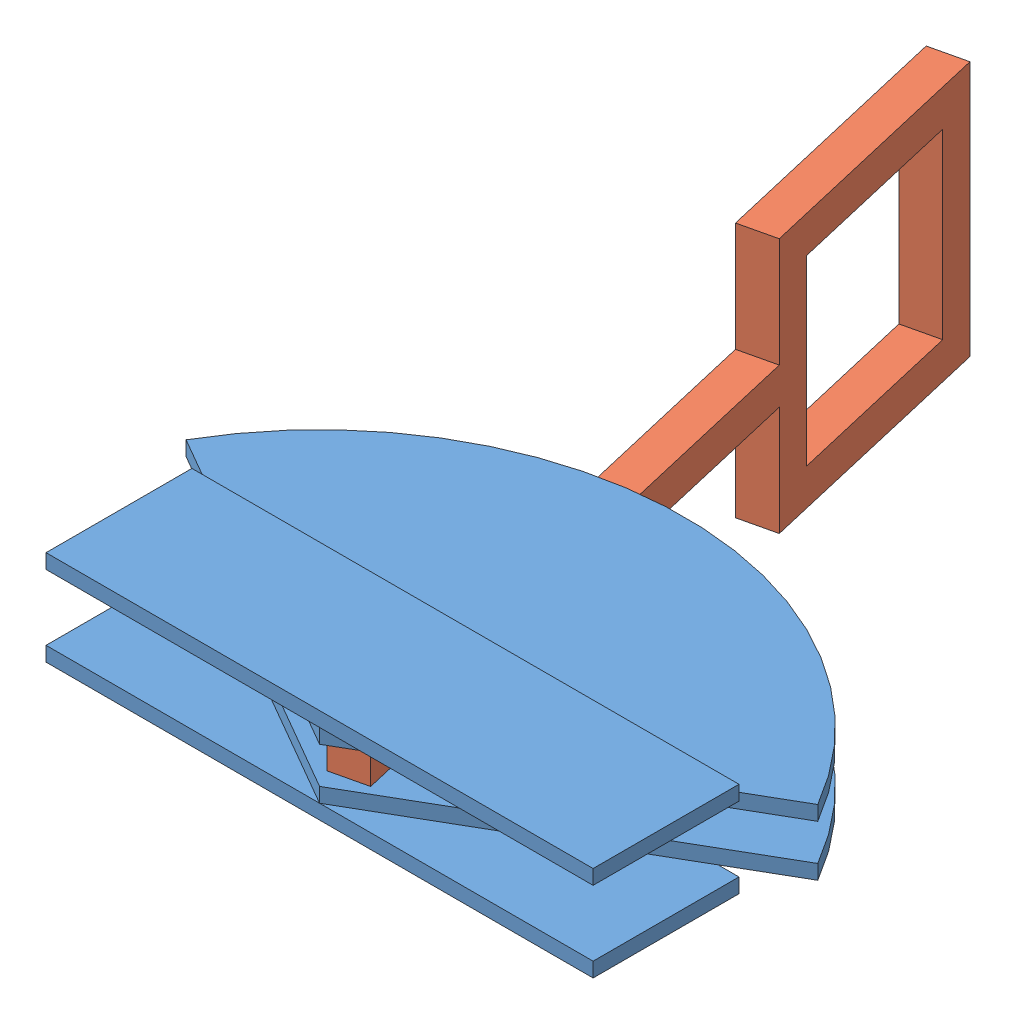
SolidWorks assembly Assem1.sldasm, configuration Default (file format 11000). Lengths in mm.
Overall size (346.41 140 442.46).
2 component instances, 2 part files, 3 mates.
Components (placement in the parent):
- throtle stand-1: throtle stand.SLDPRT [Default] at (121.2829 103.8401 322.4019) size (346.41 52 200)
- throtle handle-1: throtle handle.SLDPRT [Default] at (115.88 103.8401 312.9939) x (0 -1 0) z (0.227003 0 0.973894) size (140 20 440)
Mates (geometry in assembly coordinates):
- Concentric1: concentric: cylinder of throtle stand-1 through (121.2829 83.8401 293.7104) axis (0 1 0) radius 4; cylinder of throtle handle-1 through (121.2829 103.8401 293.7104) axis (0 -1 0) radius 4
- Coincident2: coincident: plane of throtle stand-1 through (121.2829 83.8401 322.4019) normal (0 1 0); plane of throtle handle-1 through (135.3579 83.8401 308.4538) normal (0 -1 0)
- Coincident3: coincident: plane of throtle stand-1 through (121.2829 103.8401 322.4019) normal (0 -1 0); plane of throtle handle-1 through (135.3579 103.8401 308.4538) normal (0 1 0)
